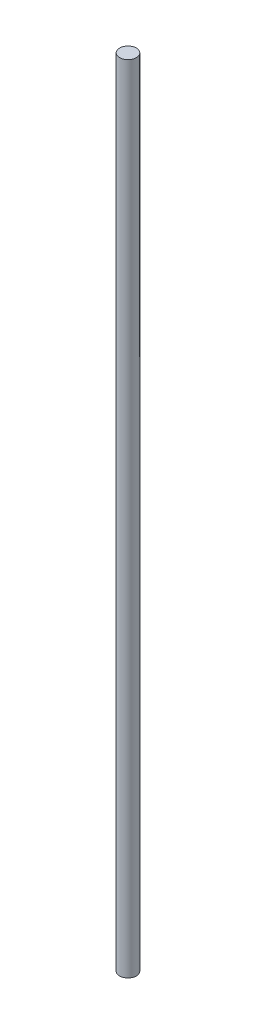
ISO-10303-21;
HEADER;
FILE_DESCRIPTION(('STEP AP214'),'2;1');
FILE_NAME('part.step','',(''),(''),'','','');
FILE_SCHEMA(('AUTOMOTIVE_DESIGN { 1 0 10303 214 1 1 1 1 }'));
ENDSEC;
DATA;
#1=APPLICATION_CONTEXT('core data for automotive mechanical design processes');
#2=APPLICATION_PROTOCOL_DEFINITION('international standard','automotive_design',2000,#1);
#3=PRODUCT_CONTEXT('',#1,'mechanical');
#4=PRODUCT('Part','Part','',(#3));
#5=PRODUCT_RELATED_PRODUCT_CATEGORY('part','',(#4));
#6=PRODUCT_DEFINITION_FORMATION('','',#4);
#7=PRODUCT_DEFINITION_CONTEXT('part definition',#1,'design');
#8=PRODUCT_DEFINITION('design','',#6,#7);
#9=PRODUCT_DEFINITION_SHAPE('','',#8);
#10=(LENGTH_UNIT() NAMED_UNIT(*) SI_UNIT(.MILLI.,.METRE.));
#11=(NAMED_UNIT(*) PLANE_ANGLE_UNIT() SI_UNIT($,.RADIAN.));
#12=(NAMED_UNIT(*) SI_UNIT($,.STERADIAN.) SOLID_ANGLE_UNIT());
#13=UNCERTAINTY_MEASURE_WITH_UNIT(LENGTH_MEASURE(1.E-05),#10,'distance_accuracy_value','');
#14=(GEOMETRIC_REPRESENTATION_CONTEXT(3) GLOBAL_UNCERTAINTY_ASSIGNED_CONTEXT((#13)) GLOBAL_UNIT_ASSIGNED_CONTEXT((#10,
#11,#12)) REPRESENTATION_CONTEXT('',''));
#15=CARTESIAN_POINT('',(0.,0.,0.));
#16=DIRECTION('',(0.,0.,1.));
#17=DIRECTION('',(1.,0.,0.));
#18=AXIS2_PLACEMENT_3D('',#15,#16,#17);
#19=CARTESIAN_POINT('',(0.,300.,0.));
#20=DIRECTION('',(0.,-1.,0.));
#21=DIRECTION('',(0.,0.,-1.));
#22=AXIS2_PLACEMENT_3D('',#19,#20,#21);
#23=CYLINDRICAL_SURFACE('',#22,3.15);
#24=CARTESIAN_POINT('',(0.,300.,0.));
#25=DIRECTION('',(0.,1.,0.));
#26=DIRECTION('',(0.,0.,1.));
#27=AXIS2_PLACEMENT_3D('',#24,#25,#26);
#28=CIRCLE('',#27,3.15);
#29=CARTESIAN_POINT('',(0.,300.,3.15));
#30=VERTEX_POINT('',#29);
#31=EDGE_CURVE('E10',#30,#30,#28,.T.);
#32=ORIENTED_EDGE('',*,*,#31,.F.);
#33=EDGE_LOOP('',(#32));
#34=FACE_BOUND('',#33,.T.);
#35=CARTESIAN_POINT('',(0.,0.,0.));
#36=DIRECTION('',(0.,1.,0.));
#37=DIRECTION('',(0.,0.,1.));
#38=AXIS2_PLACEMENT_3D('',#35,#36,#37);
#39=CIRCLE('',#38,3.15);
#40=CARTESIAN_POINT('',(0.,0.,3.15));
#41=VERTEX_POINT('',#40);
#42=EDGE_CURVE('E33',#41,#41,#39,.T.);
#43=ORIENTED_EDGE('',*,*,#42,.T.);
#44=EDGE_LOOP('',(#43));
#45=FACE_BOUND('',#44,.T.);
#46=ADVANCED_FACE('F30',(#34,#45),#23,.T.);
#47=CARTESIAN_POINT('',(0.,300.,0.));
#48=DIRECTION('',(0.,1.,0.));
#49=DIRECTION('',(0.,0.,1.));
#50=AXIS2_PLACEMENT_3D('',#47,#48,#49);
#51=PLANE('',#50);
#52=ORIENTED_EDGE('',*,*,#31,.T.);
#53=EDGE_LOOP('',(#52));
#54=FACE_BOUND('',#53,.T.);
#55=ADVANCED_FACE('F45',(#54),#51,.T.);
#56=CARTESIAN_POINT('',(0.,0.,0.));
#57=DIRECTION('',(0.,1.,0.));
#58=DIRECTION('',(0.,0.,1.));
#59=AXIS2_PLACEMENT_3D('',#56,#57,#58);
#60=PLANE('',#59);
#61=ORIENTED_EDGE('',*,*,#42,.F.);
#62=EDGE_LOOP('',(#61));
#63=FACE_BOUND('',#62,.T.);
#64=ADVANCED_FACE('F43',(#63),#60,.F.);
#65=CLOSED_SHELL('',(#46,#55,#64));
#66=MANIFOLD_SOLID_BREP('B2',#65);
#67=ADVANCED_BREP_SHAPE_REPRESENTATION('',(#18,#66),#14);
#68=SHAPE_DEFINITION_REPRESENTATION(#9,#67);
ENDSEC;
END-ISO-10303-21;
